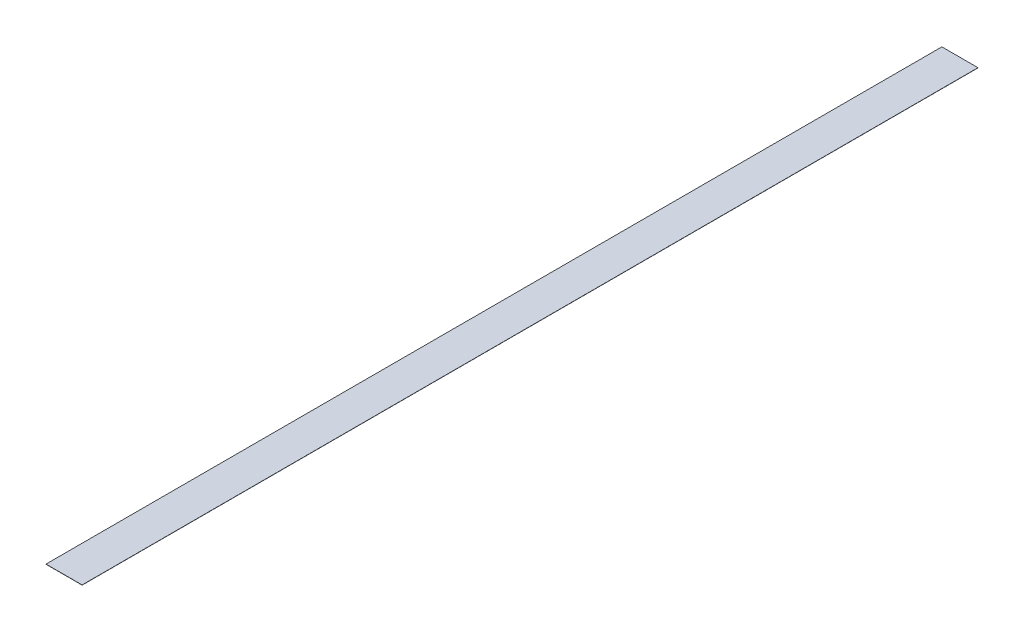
from build123d import *

# Parameters (mm, degrees)
SKETCH1_W           = 47.625
SKETCH1_H           = 1181.1
BOSS_EXTRUDE1_DEPTH = 0.254


with BuildPart() as part:
    # Sketch1 → Boss-Extrude1 (new body)
    with BuildSketch(Plane(origin=(0, 0, 0), x_dir=(1, 0, 0), z_dir=(0, 1, 0))):
        Rectangle(SKETCH1_W, SKETCH1_H)
    extrude(amount=BOSS_EXTRUDE1_DEPTH)


solid = part.part
